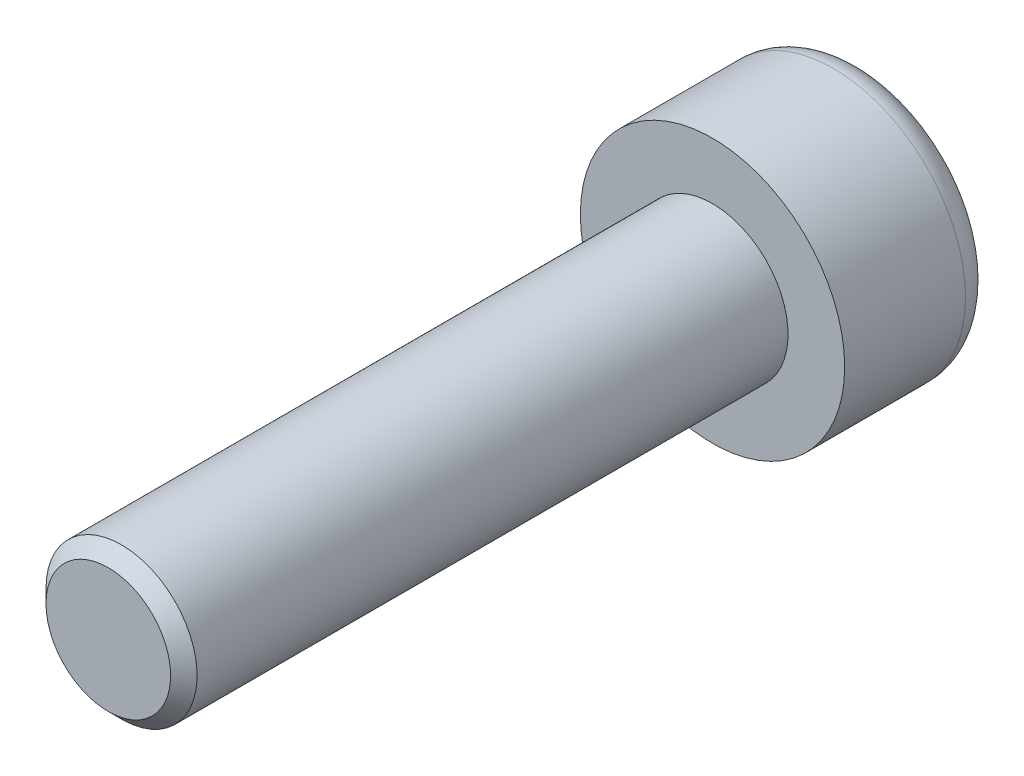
ISO-10303-21;
HEADER;
FILE_DESCRIPTION(('STEP AP214'),'2;1');
FILE_NAME('part.step','',(''),(''),'','','');
FILE_SCHEMA(('AUTOMOTIVE_DESIGN { 1 0 10303 214 1 1 1 1 }'));
ENDSEC;
DATA;
#1=APPLICATION_CONTEXT('core data for automotive mechanical design processes');
#2=APPLICATION_PROTOCOL_DEFINITION('international standard','automotive_design',2000,#1);
#3=PRODUCT_CONTEXT('',#1,'mechanical');
#4=PRODUCT('Part','Part','',(#3));
#5=PRODUCT_RELATED_PRODUCT_CATEGORY('part','',(#4));
#6=PRODUCT_DEFINITION_FORMATION('','',#4);
#7=PRODUCT_DEFINITION_CONTEXT('part definition',#1,'design');
#8=PRODUCT_DEFINITION('design','',#6,#7);
#9=PRODUCT_DEFINITION_SHAPE('','',#8);
#10=(LENGTH_UNIT() NAMED_UNIT(*) SI_UNIT(.MILLI.,.METRE.));
#11=(NAMED_UNIT(*) PLANE_ANGLE_UNIT() SI_UNIT($,.RADIAN.));
#12=(NAMED_UNIT(*) SI_UNIT($,.STERADIAN.) SOLID_ANGLE_UNIT());
#13=UNCERTAINTY_MEASURE_WITH_UNIT(LENGTH_MEASURE(1.E-05),#10,'distance_accuracy_value','');
#14=(GEOMETRIC_REPRESENTATION_CONTEXT(3) GLOBAL_UNCERTAINTY_ASSIGNED_CONTEXT((#13)) GLOBAL_UNIT_ASSIGNED_CONTEXT((#10,
#11,#12)) REPRESENTATION_CONTEXT('',''));
#15=CARTESIAN_POINT('',(0.,0.,0.));
#16=DIRECTION('',(0.,0.,1.));
#17=DIRECTION('',(1.,0.,0.));
#18=AXIS2_PLACEMENT_3D('',#15,#16,#17);
#19=CARTESIAN_POINT('',(-1.5,-0.866025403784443,2.5));
#20=DIRECTION('',(-0.500000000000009,-0.866025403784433,0.));
#21=DIRECTION('',(0.866025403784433,-0.500000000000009,0.));
#22=AXIS2_PLACEMENT_3D('',#19,#20,#21);
#23=PLANE('',#22);
#24=DIRECTION('',(0.,0.,1.));
#25=VECTOR('',#24,1.);
#26=CARTESIAN_POINT('',(-1.5,-0.866025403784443,2.5));
#27=LINE('',#26,#25);
#28=CARTESIAN_POINT('',(-1.5,-0.866025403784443,0.));
#29=VERTEX_POINT('',#28);
#30=CARTESIAN_POINT('',(-1.5,-0.866025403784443,2.5));
#31=VERTEX_POINT('',#30);
#32=EDGE_CURVE('E87',#29,#31,#27,.T.);
#33=ORIENTED_EDGE('',*,*,#32,.T.);
#34=DIRECTION('',(0.866025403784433,-0.500000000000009,0.));
#35=VECTOR('',#34,1.);
#36=CARTESIAN_POINT('',(-1.5,-0.866025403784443,2.5));
#37=LINE('',#36,#35);
#38=CARTESIAN_POINT('',(0.,-1.7320508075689,2.5));
#39=VERTEX_POINT('',#38);
#40=EDGE_CURVE('E76',#39,#31,#37,.F.);
#41=ORIENTED_EDGE('',*,*,#40,.F.);
#42=DIRECTION('',(0.,0.,1.));
#43=VECTOR('',#42,1.);
#44=CARTESIAN_POINT('',(0.,-1.7320508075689,2.5));
#45=LINE('',#44,#43);
#46=CARTESIAN_POINT('',(0.,-1.7320508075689,0.));
#47=VERTEX_POINT('',#46);
#48=EDGE_CURVE('E96',#39,#47,#45,.F.);
#49=ORIENTED_EDGE('',*,*,#48,.T.);
#50=DIRECTION('',(0.866025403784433,-0.500000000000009,0.));
#51=VECTOR('',#50,1.);
#52=CARTESIAN_POINT('',(-1.5,-0.866025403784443,0.));
#53=LINE('',#52,#51);
#54=EDGE_CURVE('E71',#29,#47,#53,.T.);
#55=ORIENTED_EDGE('',*,*,#54,.F.);
#56=EDGE_LOOP('',(#33,#41,#49,#55));
#57=FACE_BOUND('',#56,.T.);
#58=ADVANCED_FACE('F16',(#57),#23,.F.);
#59=CARTESIAN_POINT('',(-1.5,0.866025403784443,2.5));
#60=DIRECTION('',(-1.,0.,0.));
#61=DIRECTION('',(0.,0.,1.));
#62=AXIS2_PLACEMENT_3D('',#59,#60,#61);
#63=PLANE('',#62);
#64=DIRECTION('',(0.,0.,1.));
#65=VECTOR('',#64,1.);
#66=CARTESIAN_POINT('',(-1.5,0.866025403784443,2.5));
#67=LINE('',#66,#65);
#68=CARTESIAN_POINT('',(-1.5,0.866025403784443,0.));
#69=VERTEX_POINT('',#68);
#70=CARTESIAN_POINT('',(-1.5,0.866025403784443,2.5));
#71=VERTEX_POINT('',#70);
#72=EDGE_CURVE('E92',#69,#71,#67,.T.);
#73=ORIENTED_EDGE('',*,*,#72,.T.);
#74=DIRECTION('',(0.,1.,0.));
#75=VECTOR('',#74,1.);
#76=CARTESIAN_POINT('',(-1.5,0.866025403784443,2.5));
#77=LINE('',#76,#75);
#78=EDGE_CURVE('E80',#31,#71,#77,.T.);
#79=ORIENTED_EDGE('',*,*,#78,.F.);
#80=ORIENTED_EDGE('',*,*,#32,.F.);
#81=DIRECTION('',(0.,1.,0.));
#82=VECTOR('',#81,1.);
#83=CARTESIAN_POINT('',(-1.5,0.866025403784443,0.));
#84=LINE('',#83,#82);
#85=EDGE_CURVE('E94',#69,#29,#84,.F.);
#86=ORIENTED_EDGE('',*,*,#85,.F.);
#87=EDGE_LOOP('',(#73,#79,#80,#86));
#88=FACE_BOUND('',#87,.T.);
#89=ADVANCED_FACE('F90',(#88),#63,.F.);
#90=CARTESIAN_POINT('',(1.5,-0.866025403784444,2.5));
#91=DIRECTION('',(0.500000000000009,-0.866025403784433,0.));
#92=DIRECTION('',(0.866025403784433,0.500000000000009,0.));
#93=AXIS2_PLACEMENT_3D('',#90,#91,#92);
#94=PLANE('',#93);
#95=ORIENTED_EDGE('',*,*,#48,.F.);
#96=DIRECTION('',(0.866025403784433,0.500000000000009,0.));
#97=VECTOR('',#96,1.);
#98=CARTESIAN_POINT('',(0.,-1.7320508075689,2.5));
#99=LINE('',#98,#97);
#100=CARTESIAN_POINT('',(1.5,-0.866025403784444,2.5));
#101=VERTEX_POINT('',#100);
#102=EDGE_CURVE('E83',#39,#101,#99,.T.);
#103=ORIENTED_EDGE('',*,*,#102,.T.);
#104=DIRECTION('',(0.,0.,-1.));
#105=VECTOR('',#104,1.);
#106=CARTESIAN_POINT('',(1.5,-0.866025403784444,2.5));
#107=LINE('',#106,#105);
#108=CARTESIAN_POINT('',(1.5,-0.866025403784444,0.));
#109=VERTEX_POINT('',#108);
#110=EDGE_CURVE('E292',#101,#109,#107,.T.);
#111=ORIENTED_EDGE('',*,*,#110,.T.);
#112=DIRECTION('',(0.866025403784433,0.500000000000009,0.));
#113=VECTOR('',#112,1.);
#114=CARTESIAN_POINT('',(1.5,-0.866025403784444,0.));
#115=LINE('',#114,#113);
#116=EDGE_CURVE('E281',#47,#109,#115,.T.);
#117=ORIENTED_EDGE('',*,*,#116,.F.);
#118=EDGE_LOOP('',(#95,#103,#111,#117));
#119=FACE_BOUND('',#118,.T.);
#120=ADVANCED_FACE('F244',(#119),#94,.F.);
#121=CARTESIAN_POINT('',(0.,1.7320508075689,2.5));
#122=DIRECTION('',(-0.500000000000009,0.866025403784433,0.));
#123=DIRECTION('',(-0.866025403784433,-0.500000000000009,0.));
#124=AXIS2_PLACEMENT_3D('',#121,#122,#123);
#125=PLANE('',#124);
#126=DIRECTION('',(0.,0.,1.));
#127=VECTOR('',#126,1.);
#128=CARTESIAN_POINT('',(0.,1.7320508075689,2.5));
#129=LINE('',#128,#127);
#130=CARTESIAN_POINT('',(0.,1.7320508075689,0.));
#131=VERTEX_POINT('',#130);
#132=CARTESIAN_POINT('',(0.,1.7320508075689,2.5));
#133=VERTEX_POINT('',#132);
#134=EDGE_CURVE('E297',#131,#133,#129,.T.);
#135=ORIENTED_EDGE('',*,*,#134,.T.);
#136=DIRECTION('',(-0.866025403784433,-0.500000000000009,0.));
#137=VECTOR('',#136,1.);
#138=CARTESIAN_POINT('',(0.,1.7320508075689,2.5));
#139=LINE('',#138,#137);
#140=EDGE_CURVE('E288',#133,#71,#139,.T.);
#141=ORIENTED_EDGE('',*,*,#140,.T.);
#142=ORIENTED_EDGE('',*,*,#72,.F.);
#143=DIRECTION('',(-0.866025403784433,-0.500000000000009,0.));
#144=VECTOR('',#143,1.);
#145=CARTESIAN_POINT('',(0.,1.7320508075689,0.));
#146=LINE('',#145,#144);
#147=EDGE_CURVE('E285',#131,#69,#146,.T.);
#148=ORIENTED_EDGE('',*,*,#147,.F.);
#149=EDGE_LOOP('',(#135,#141,#142,#148));
#150=FACE_BOUND('',#149,.T.);
#151=ADVANCED_FACE('F235',(#150),#125,.F.);
#152=CARTESIAN_POINT('',(-2.99999999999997,0.,2.5));
#153=DIRECTION('',(0.,0.,1.));
#154=DIRECTION('',(1.,0.,0.));
#155=AXIS2_PLACEMENT_3D('',#152,#153,#154);
#156=PLANE('',#155);
#157=DIRECTION('',(-0.866025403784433,0.500000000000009,0.));
#158=VECTOR('',#157,1.);
#159=CARTESIAN_POINT('',(0.,1.7320508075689,2.5));
#160=LINE('',#159,#158);
#161=CARTESIAN_POINT('',(1.5,0.866025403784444,2.5));
#162=VERTEX_POINT('',#161);
#163=EDGE_CURVE('E120',#133,#162,#160,.F.);
#164=ORIENTED_EDGE('',*,*,#163,.T.);
#165=DIRECTION('',(0.,1.,0.));
#166=VECTOR('',#165,1.);
#167=CARTESIAN_POINT('',(1.5,0.866025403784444,2.5));
#168=LINE('',#167,#166);
#169=EDGE_CURVE('E290',#162,#101,#168,.F.);
#170=ORIENTED_EDGE('',*,*,#169,.T.);
#171=ORIENTED_EDGE('',*,*,#102,.F.);
#172=ORIENTED_EDGE('',*,*,#40,.T.);
#173=ORIENTED_EDGE('',*,*,#78,.T.);
#174=ORIENTED_EDGE('',*,*,#140,.F.);
#175=EDGE_LOOP('',(#164,#170,#171,#172,#173,#174));
#176=FACE_BOUND('',#175,.T.);
#177=ADVANCED_FACE('F77',(#176),#156,.F.);
#178=CARTESIAN_POINT('',(1.5,0.866025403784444,2.5));
#179=DIRECTION('',(1.,0.,0.));
#180=DIRECTION('',(0.,0.,-1.));
#181=AXIS2_PLACEMENT_3D('',#178,#179,#180);
#182=PLANE('',#181);
#183=ORIENTED_EDGE('',*,*,#110,.F.);
#184=ORIENTED_EDGE('',*,*,#169,.F.);
#185=DIRECTION('',(0.,0.,1.));
#186=VECTOR('',#185,1.);
#187=CARTESIAN_POINT('',(1.5,0.866025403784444,2.5));
#188=LINE('',#187,#186);
#189=CARTESIAN_POINT('',(1.5,0.866025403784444,0.));
#190=VERTEX_POINT('',#189);
#191=EDGE_CURVE('E113',#162,#190,#188,.F.);
#192=ORIENTED_EDGE('',*,*,#191,.T.);
#193=DIRECTION('',(0.,1.,0.));
#194=VECTOR('',#193,1.);
#195=CARTESIAN_POINT('',(1.5,0.866025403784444,0.));
#196=LINE('',#195,#194);
#197=EDGE_CURVE('E294',#109,#190,#196,.T.);
#198=ORIENTED_EDGE('',*,*,#197,.F.);
#199=EDGE_LOOP('',(#183,#184,#192,#198));
#200=FACE_BOUND('',#199,.T.);
#201=ADVANCED_FACE('F165',(#200),#182,.F.);
#202=CARTESIAN_POINT('',(0.,1.7320508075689,2.5));
#203=DIRECTION('',(0.500000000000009,0.866025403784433,0.));
#204=DIRECTION('',(-0.866025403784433,0.500000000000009,0.));
#205=AXIS2_PLACEMENT_3D('',#202,#203,#204);
#206=PLANE('',#205);
#207=ORIENTED_EDGE('',*,*,#191,.F.);
#208=ORIENTED_EDGE('',*,*,#163,.F.);
#209=ORIENTED_EDGE('',*,*,#134,.F.);
#210=DIRECTION('',(0.866025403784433,-0.500000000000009,0.));
#211=VECTOR('',#210,1.);
#212=CARTESIAN_POINT('',(0.,1.7320508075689,0.));
#213=LINE('',#212,#211);
#214=EDGE_CURVE('E111',#131,#190,#213,.T.);
#215=ORIENTED_EDGE('',*,*,#214,.T.);
#216=EDGE_LOOP('',(#207,#208,#209,#215));
#217=FACE_BOUND('',#216,.T.);
#218=ADVANCED_FACE('F159',(#217),#206,.F.);
#219=CARTESIAN_POINT('',(0.,0.,0.));
#220=DIRECTION('',(0.,0.,1.));
#221=DIRECTION('',(1.,0.,0.));
#222=AXIS2_PLACEMENT_3D('',#219,#220,#221);
#223=PLANE('',#222);
#224=ORIENTED_EDGE('',*,*,#147,.T.);
#225=ORIENTED_EDGE('',*,*,#85,.T.);
#226=ORIENTED_EDGE('',*,*,#54,.T.);
#227=ORIENTED_EDGE('',*,*,#116,.T.);
#228=ORIENTED_EDGE('',*,*,#197,.T.);
#229=ORIENTED_EDGE('',*,*,#214,.F.);
#230=EDGE_LOOP('',(#224,#225,#226,#227,#228,#229));
#231=FACE_BOUND('',#230,.T.);
#232=CARTESIAN_POINT('',(0.,0.,0.));
#233=DIRECTION('',(0.,0.,1.));
#234=DIRECTION('',(1.,0.,0.));
#235=AXIS2_PLACEMENT_3D('',#232,#233,#234);
#236=CIRCLE('',#235,2.7);
#237=CARTESIAN_POINT('',(2.7,0.,0.));
#238=VERTEX_POINT('',#237);
#239=CARTESIAN_POINT('',(-2.7,0.,0.));
#240=VERTEX_POINT('',#239);
#241=EDGE_CURVE('E109',#238,#240,#236,.T.);
#242=ORIENTED_EDGE('',*,*,#241,.F.);
#243=CARTESIAN_POINT('',(0.,0.,0.));
#244=DIRECTION('',(0.,0.,1.));
#245=DIRECTION('',(-1.,0.,0.));
#246=AXIS2_PLACEMENT_3D('',#243,#244,#245);
#247=CIRCLE('',#246,2.7);
#248=EDGE_CURVE('E35',#240,#238,#247,.T.);
#249=ORIENTED_EDGE('',*,*,#248,.F.);
#250=EDGE_LOOP('',(#242,#249));
#251=FACE_BOUND('',#250,.T.);
#252=ADVANCED_FACE('F140',(#231,#251),#223,.F.);
#253=CARTESIAN_POINT('',(0.,0.,0.8));
#254=DIRECTION('',(0.,0.,1.));
#255=DIRECTION('',(1.,0.,0.));
#256=AXIS2_PLACEMENT_3D('',#253,#254,#255);
#257=TOROIDAL_SURFACE('',#256,2.7,0.8);
#258=CARTESIAN_POINT('',(0.,0.,0.8));
#259=DIRECTION('',(0.,0.,-1.));
#260=DIRECTION('',(-1.,0.,0.));
#261=AXIS2_PLACEMENT_3D('',#258,#259,#260);
#262=CIRCLE('',#261,3.5);
#263=CARTESIAN_POINT('',(-3.5,0.,0.8));
#264=VERTEX_POINT('',#263);
#265=EDGE_CURVE('E106',#264,#264,#262,.F.);
#266=ORIENTED_EDGE('',*,*,#265,.F.);
#267=EDGE_LOOP('',(#266));
#268=FACE_BOUND('',#267,.T.);
#269=ORIENTED_EDGE('',*,*,#241,.T.);
#270=ORIENTED_EDGE('',*,*,#248,.T.);
#271=EDGE_LOOP('',(#269,#270));
#272=FACE_BOUND('',#271,.T.);
#273=ADVANCED_FACE('F108',(#268,#272),#257,.T.);
#274=CARTESIAN_POINT('',(0.,0.,20.));
#275=DIRECTION('',(0.,0.,1.));
#276=DIRECTION('',(1.,0.,0.));
#277=AXIS2_PLACEMENT_3D('',#274,#275,#276);
#278=PLANE('',#277);
#279=CARTESIAN_POINT('',(0.,0.,19.9999999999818));
#280=DIRECTION('',(0.,0.,-1.));
#281=DIRECTION('',(-1.,0.,0.));
#282=AXIS2_PLACEMENT_3D('',#279,#280,#281);
#283=CIRCLE('',#282,1.65000000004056);
#284=CARTESIAN_POINT('',(-1.65000000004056,0.,19.9999999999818));
#285=VERTEX_POINT('',#284);
#286=EDGE_CURVE('E104',#285,#285,#283,.T.);
#287=ORIENTED_EDGE('',*,*,#286,.F.);
#288=EDGE_LOOP('',(#287));
#289=FACE_BOUND('',#288,.T.);
#290=ADVANCED_FACE('F139',(#289),#278,.T.);
#291=CARTESIAN_POINT('',(0.,0.,4.));
#292=DIRECTION('',(0.,0.,-1.));
#293=DIRECTION('',(-1.,0.,0.));
#294=AXIS2_PLACEMENT_3D('',#291,#292,#293);
#295=CYLINDRICAL_SURFACE('',#294,3.5);
#296=ORIENTED_EDGE('',*,*,#265,.T.);
#297=EDGE_LOOP('',(#296));
#298=FACE_BOUND('',#297,.T.);
#299=CARTESIAN_POINT('',(0.,0.,4.));
#300=DIRECTION('',(0.,0.,-1.));
#301=DIRECTION('',(-1.,0.,0.));
#302=AXIS2_PLACEMENT_3D('',#299,#300,#301);
#303=CIRCLE('',#302,3.5);
#304=CARTESIAN_POINT('',(-3.5,0.,4.));
#305=VERTEX_POINT('',#304);
#306=EDGE_CURVE('E101',#305,#305,#303,.F.);
#307=ORIENTED_EDGE('',*,*,#306,.F.);
#308=EDGE_LOOP('',(#307));
#309=FACE_BOUND('',#308,.T.);
#310=ADVANCED_FACE('F181',(#298,#309),#295,.T.);
#311=CARTESIAN_POINT('',(0.,0.,19.6500000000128));
#312=DIRECTION('',(0.,0.,-1.));
#313=DIRECTION('',(-1.,0.,0.));
#314=AXIS2_PLACEMENT_3D('',#311,#312,#313);
#315=CONICAL_SURFACE('',#314,2.00000000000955,0.785398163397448);
#316=CARTESIAN_POINT('',(0.,0.,19.65));
#317=DIRECTION('',(0.,0.,-1.));
#318=DIRECTION('',(-1.,0.,0.));
#319=AXIS2_PLACEMENT_3D('',#316,#317,#318);
#320=CIRCLE('',#319,2.);
#321=CARTESIAN_POINT('',(-2.,0.,19.65));
#322=VERTEX_POINT('',#321);
#323=EDGE_CURVE('E27',#322,#322,#320,.T.);
#324=ORIENTED_EDGE('',*,*,#323,.F.);
#325=EDGE_LOOP('',(#324));
#326=FACE_BOUND('',#325,.T.);
#327=ORIENTED_EDGE('',*,*,#286,.T.);
#328=EDGE_LOOP('',(#327));
#329=FACE_BOUND('',#328,.T.);
#330=ADVANCED_FACE('F175',(#326,#329),#315,.T.);
#331=CARTESIAN_POINT('',(0.,0.,4.));
#332=DIRECTION('',(0.,0.,1.));
#333=DIRECTION('',(1.,0.,0.));
#334=AXIS2_PLACEMENT_3D('',#331,#332,#333);
#335=PLANE('',#334);
#336=CARTESIAN_POINT('',(0.,0.,4.));
#337=DIRECTION('',(0.,0.,-1.));
#338=DIRECTION('',(-1.,0.,0.));
#339=AXIS2_PLACEMENT_3D('',#336,#337,#338);
#340=CIRCLE('',#339,2.);
#341=CARTESIAN_POINT('',(-2.,0.,4.));
#342=VERTEX_POINT('',#341);
#343=EDGE_CURVE('E11',#342,#342,#340,.F.);
#344=ORIENTED_EDGE('',*,*,#343,.F.);
#345=EDGE_LOOP('',(#344));
#346=FACE_BOUND('',#345,.T.);
#347=ORIENTED_EDGE('',*,*,#306,.T.);
#348=EDGE_LOOP('',(#347));
#349=FACE_BOUND('',#348,.T.);
#350=ADVANCED_FACE('F169',(#346,#349),#335,.T.);
#351=CARTESIAN_POINT('',(0.,0.,20.));
#352=DIRECTION('',(0.,0.,-1.));
#353=DIRECTION('',(-1.,0.,0.));
#354=AXIS2_PLACEMENT_3D('',#351,#352,#353);
#355=CYLINDRICAL_SURFACE('',#354,2.);
#356=ORIENTED_EDGE('',*,*,#343,.T.);
#357=EDGE_LOOP('',(#356));
#358=FACE_BOUND('',#357,.T.);
#359=ORIENTED_EDGE('',*,*,#323,.T.);
#360=EDGE_LOOP('',(#359));
#361=FACE_BOUND('',#360,.T.);
#362=ADVANCED_FACE('F167',(#358,#361),#355,.T.);
#363=CLOSED_SHELL('',(#58,#89,#120,#151,#177,#201,#218,#252,#273,#290,#310,#330,#350,#362));
#364=MANIFOLD_SOLID_BREP('B1',#363);
#365=ADVANCED_BREP_SHAPE_REPRESENTATION('',(#18,#364),#14);
#366=SHAPE_DEFINITION_REPRESENTATION(#9,#365);
ENDSEC;
END-ISO-10303-21;
